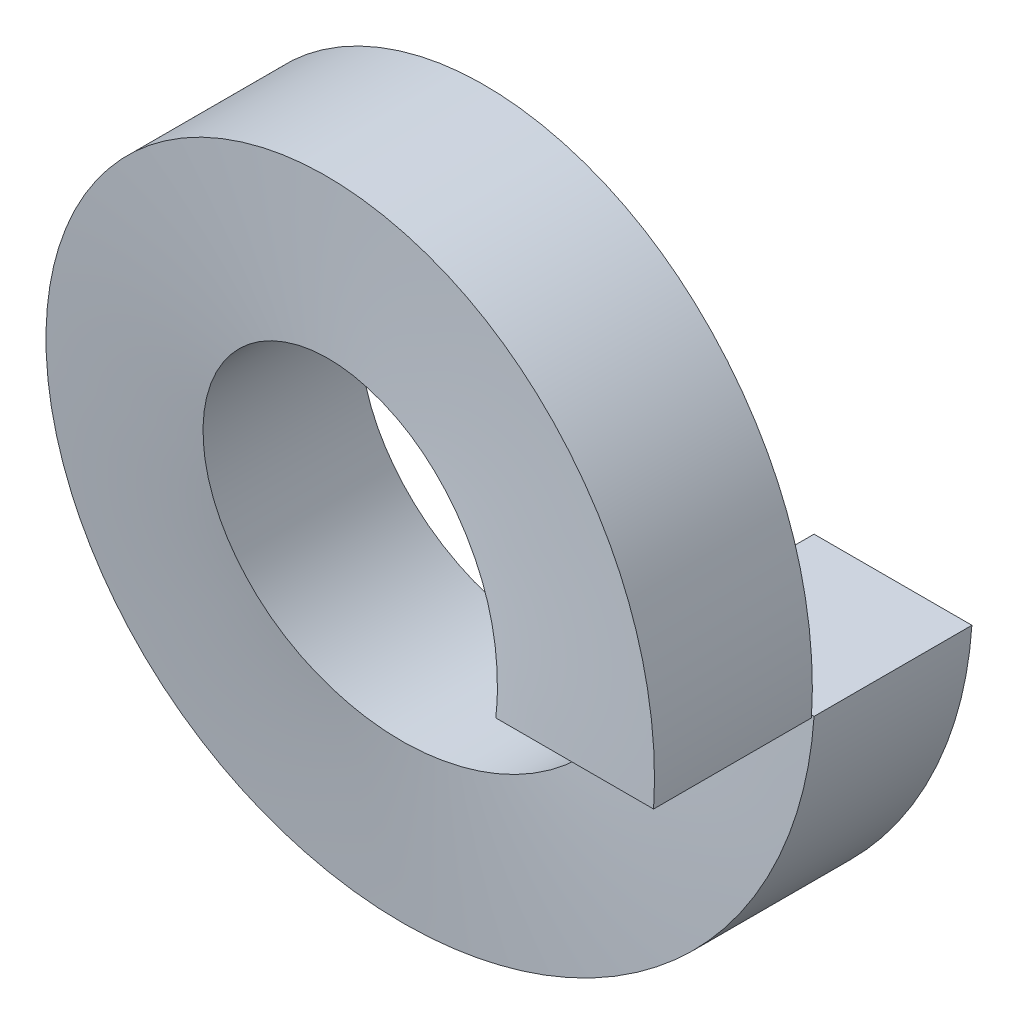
ISO-10303-21;
HEADER;
FILE_DESCRIPTION(('STEP AP214'),'2;1');
FILE_NAME('part.step','',(''),(''),'','','');
FILE_SCHEMA(('AUTOMOTIVE_DESIGN { 1 0 10303 214 1 1 1 1 }'));
ENDSEC;
DATA;
#1=APPLICATION_CONTEXT('core data for automotive mechanical design processes');
#2=APPLICATION_PROTOCOL_DEFINITION('international standard','automotive_design',2000,#1);
#3=PRODUCT_CONTEXT('',#1,'mechanical');
#4=PRODUCT('Part','Part','',(#3));
#5=PRODUCT_RELATED_PRODUCT_CATEGORY('part','',(#4));
#6=PRODUCT_DEFINITION_FORMATION('','',#4);
#7=PRODUCT_DEFINITION_CONTEXT('part definition',#1,'design');
#8=PRODUCT_DEFINITION('design','',#6,#7);
#9=PRODUCT_DEFINITION_SHAPE('','',#8);
#10=(LENGTH_UNIT() NAMED_UNIT(*) SI_UNIT(.MILLI.,.METRE.));
#11=(NAMED_UNIT(*) PLANE_ANGLE_UNIT() SI_UNIT($,.RADIAN.));
#12=(NAMED_UNIT(*) SI_UNIT($,.STERADIAN.) SOLID_ANGLE_UNIT());
#13=UNCERTAINTY_MEASURE_WITH_UNIT(LENGTH_MEASURE(1.E-05),#10,'distance_accuracy_value','');
#14=(GEOMETRIC_REPRESENTATION_CONTEXT(3) GLOBAL_UNCERTAINTY_ASSIGNED_CONTEXT((#13)) GLOBAL_UNIT_ASSIGNED_CONTEXT((#10,
#11,#12)) REPRESENTATION_CONTEXT('',''));
#15=CARTESIAN_POINT('',(0.,0.,0.));
#16=DIRECTION('',(0.,0.,1.));
#17=DIRECTION('',(1.,0.,0.));
#18=AXIS2_PLACEMENT_3D('',#15,#16,#17);
#19=CARTESIAN_POINT('',(3.05,0.,0.910000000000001));
#20=DIRECTION('',(0.,1.,0.));
#21=DIRECTION('',(0.,0.,1.));
#22=AXIS2_PLACEMENT_3D('',#19,#20,#21);
#23=PLANE('',#22);
#24=DIRECTION('',(1.,0.,0.));
#25=VECTOR('',#24,1.);
#26=CARTESIAN_POINT('',(3.05,0.,0.910000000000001));
#27=LINE('',#26,#25);
#28=CARTESIAN_POINT('',(2.14,0.,0.910000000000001));
#29=VERTEX_POINT('',#28);
#30=CARTESIAN_POINT('',(3.96,0.,0.910000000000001));
#31=VERTEX_POINT('',#30);
#32=EDGE_CURVE('E41',#29,#31,#27,.T.);
#33=ORIENTED_EDGE('',*,*,#32,.T.);
#34=DIRECTION('',(0.,0.,-1.));
#35=VECTOR('',#34,1.);
#36=CARTESIAN_POINT('',(3.96,0.,0.));
#37=LINE('',#36,#35);
#38=CARTESIAN_POINT('',(3.96,0.,-0.910000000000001));
#39=VERTEX_POINT('',#38);
#40=EDGE_CURVE('E36',#31,#39,#37,.T.);
#41=ORIENTED_EDGE('',*,*,#40,.T.);
#42=DIRECTION('',(-1.,0.,0.));
#43=VECTOR('',#42,1.);
#44=CARTESIAN_POINT('',(3.05,0.,-0.910000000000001));
#45=LINE('',#44,#43);
#46=CARTESIAN_POINT('',(2.14,0.,-0.910000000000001));
#47=VERTEX_POINT('',#46);
#48=EDGE_CURVE('E76',#39,#47,#45,.T.);
#49=ORIENTED_EDGE('',*,*,#48,.T.);
#50=DIRECTION('',(0.,0.,1.));
#51=VECTOR('',#50,1.);
#52=CARTESIAN_POINT('',(2.14,0.,0.));
#53=LINE('',#52,#51);
#54=EDGE_CURVE('E57',#47,#29,#53,.T.);
#55=ORIENTED_EDGE('',*,*,#54,.T.);
#56=EDGE_LOOP('',(#33,#41,#49,#55));
#57=FACE_BOUND('',#56,.T.);
#58=ADVANCED_FACE('F32',(#57),#23,.T.);
#59=CARTESIAN_POINT('',(3.05,0.,2.76));
#60=DIRECTION('',(0.,-1.,0.));
#61=DIRECTION('',(0.,0.,-1.));
#62=AXIS2_PLACEMENT_3D('',#59,#60,#61);
#63=PLANE('',#62);
#64=DIRECTION('',(-1.,0.,0.));
#65=VECTOR('',#64,1.);
#66=CARTESIAN_POINT('',(3.05,0.,2.76));
#67=LINE('',#66,#65);
#68=CARTESIAN_POINT('',(3.96,0.,2.76));
#69=VERTEX_POINT('',#68);
#70=CARTESIAN_POINT('',(2.14,0.,2.76));
#71=VERTEX_POINT('',#70);
#72=EDGE_CURVE('E11',#69,#71,#67,.T.);
#73=ORIENTED_EDGE('',*,*,#72,.T.);
#74=DIRECTION('',(0.,0.,-1.));
#75=VECTOR('',#74,1.);
#76=CARTESIAN_POINT('',(2.14,0.,1.85));
#77=LINE('',#76,#75);
#78=CARTESIAN_POINT('',(2.14,0.,0.939999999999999));
#79=VERTEX_POINT('',#78);
#80=EDGE_CURVE('E181',#71,#79,#77,.T.);
#81=ORIENTED_EDGE('',*,*,#80,.T.);
#82=DIRECTION('',(1.,0.,0.));
#83=VECTOR('',#82,1.);
#84=CARTESIAN_POINT('',(3.05,0.,0.939999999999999));
#85=LINE('',#84,#83);
#86=CARTESIAN_POINT('',(3.96,0.,0.939999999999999));
#87=VERTEX_POINT('',#86);
#88=EDGE_CURVE('E93',#79,#87,#85,.T.);
#89=ORIENTED_EDGE('',*,*,#88,.T.);
#90=DIRECTION('',(0.,0.,1.));
#91=VECTOR('',#90,1.);
#92=CARTESIAN_POINT('',(3.96,0.,1.85));
#93=LINE('',#92,#91);
#94=EDGE_CURVE('E81',#87,#69,#93,.T.);
#95=ORIENTED_EDGE('',*,*,#94,.T.);
#96=EDGE_LOOP('',(#73,#81,#89,#95));
#97=FACE_BOUND('',#96,.T.);
#98=ADVANCED_FACE('F34',(#97),#63,.T.);
#99=CARTESIAN_POINT('',(2.14,0.,0.910000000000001));
#100=CARTESIAN_POINT('',(2.14,-0.695328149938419,1.0025));
#101=CARTESIAN_POINT('',(1.73129636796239,-1.25786043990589,1.095));
#102=CARTESIAN_POINT('',(1.32259273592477,-1.82039272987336,1.1875));
#103=CARTESIAN_POINT('',(0.661296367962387,-2.03526094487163,1.28));
#104=CARTESIAN_POINT('',(0.,-2.25012915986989,1.3725));
#105=CARTESIAN_POINT('',(-0.661296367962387,-2.03526094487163,1.465));
#106=CARTESIAN_POINT('',(-1.32259273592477,-1.82039272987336,1.5575));
#107=CARTESIAN_POINT('',(-1.73129636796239,-1.25786043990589,1.65));
#108=CARTESIAN_POINT('',(-2.14,-0.69532814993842,1.7425));
#109=CARTESIAN_POINT('',(-2.14,0.,1.835));
#110=CARTESIAN_POINT('',(-2.14,0.695328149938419,1.9275));
#111=CARTESIAN_POINT('',(-1.73129636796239,1.25786043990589,2.02));
#112=CARTESIAN_POINT('',(-1.32259273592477,1.82039272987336,2.1125));
#113=CARTESIAN_POINT('',(-0.661296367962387,2.03526094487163,2.205));
#114=CARTESIAN_POINT('',(0.,2.25012915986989,2.2975));
#115=CARTESIAN_POINT('',(0.661296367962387,2.03526094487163,2.39));
#116=CARTESIAN_POINT('',(1.32259273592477,1.82039272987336,2.4825));
#117=CARTESIAN_POINT('',(1.73129636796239,1.25786043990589,2.575));
#118=CARTESIAN_POINT('',(2.14,0.69532814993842,2.6675));
#119=CARTESIAN_POINT('',(2.14,0.,2.76));
#120=CARTESIAN_POINT('',(3.96,0.,0.910000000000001));
#121=CARTESIAN_POINT('',(3.96,-1.28668199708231,1.0025));
#122=CARTESIAN_POINT('',(3.20370729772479,-2.32762959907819,1.095));
#123=CARTESIAN_POINT('',(2.44741459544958,-3.36857720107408,1.1875));
#124=CARTESIAN_POINT('',(1.22370729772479,-3.76618380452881,1.28));
#125=CARTESIAN_POINT('',(0.,-4.16379040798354,1.3725));
#126=CARTESIAN_POINT('',(-1.22370729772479,-3.76618380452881,1.465));
#127=CARTESIAN_POINT('',(-2.44741459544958,-3.36857720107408,1.5575));
#128=CARTESIAN_POINT('',(-3.20370729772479,-2.32762959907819,1.65));
#129=CARTESIAN_POINT('',(-3.96,-1.28668199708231,1.7425));
#130=CARTESIAN_POINT('',(-3.96,0.,1.835));
#131=CARTESIAN_POINT('',(-3.96,1.28668199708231,1.9275));
#132=CARTESIAN_POINT('',(-3.20370729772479,2.32762959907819,2.02));
#133=CARTESIAN_POINT('',(-2.44741459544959,3.36857720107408,2.1125));
#134=CARTESIAN_POINT('',(-1.22370729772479,3.76618380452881,2.205));
#135=CARTESIAN_POINT('',(0.,4.16379040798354,2.2975));
#136=CARTESIAN_POINT('',(1.22370729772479,3.76618380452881,2.39));
#137=CARTESIAN_POINT('',(2.44741459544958,3.36857720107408,2.4825));
#138=CARTESIAN_POINT('',(3.20370729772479,2.3276295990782,2.575));
#139=CARTESIAN_POINT('',(3.96,1.28668199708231,2.6675));
#140=CARTESIAN_POINT('',(3.96,0.,2.76));
#141=(BOUNDED_SURFACE() B_SPLINE_SURFACE(1,2,((#99,#100,#101,#102,#103,#104,#105,#106,#107,#108,
#109,#110,#111,#112,#113,#114,#115,#116,#117,#118,#119),(#120,#121,#122,#123,#124,#125,#126,
#127,#128,#129,#130,#131,#132,#133,#134,#135,#136,#137,#138,#139,#140)),.UNSPECIFIED.,.F.,.F.,
.F.) B_SPLINE_SURFACE_WITH_KNOTS((2,2),(3,2,2,2,2,2,2,2,2,2,3),(0.,1.),(0.,0.1,0.2,0.3,0.4,0.5,
0.6,0.7,0.8,0.9,1.),
.UNSPECIFIED.) GEOMETRIC_REPRESENTATION_ITEM() RATIONAL_B_SPLINE_SURFACE(((1.,0.951056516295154,
1.,0.951056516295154,1.,0.951056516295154,1.,0.951056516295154,1.,0.951056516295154,1.,
0.951056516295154,1.,0.951056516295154,1.,0.951056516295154,1.,0.951056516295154,1.,
0.951056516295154,1.),(1.,0.951056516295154,1.,0.951056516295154,1.,0.951056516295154,1.,
0.951056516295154,1.,0.951056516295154,1.,0.951056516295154,1.,0.951056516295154,1.,
0.951056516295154,1.,0.951056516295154,1.,0.951056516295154,1.))) REPRESENTATION_ITEM('') SURFACE());
#142=CARTESIAN_POINT('',(2.14,0.,0.910000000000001));
#143=CARTESIAN_POINT('',(2.14,-0.695328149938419,1.0025));
#144=CARTESIAN_POINT('',(1.73129636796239,-1.25786043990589,1.095));
#145=CARTESIAN_POINT('',(1.32259273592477,-1.82039272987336,1.1875));
#146=CARTESIAN_POINT('',(0.661296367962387,-2.03526094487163,1.28));
#147=CARTESIAN_POINT('',(0.,-2.25012915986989,1.3725));
#148=CARTESIAN_POINT('',(-0.661296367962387,-2.03526094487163,1.465));
#149=CARTESIAN_POINT('',(-1.32259273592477,-1.82039272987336,1.5575));
#150=CARTESIAN_POINT('',(-1.73129636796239,-1.25786043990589,1.65));
#151=CARTESIAN_POINT('',(-2.14,-0.69532814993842,1.7425));
#152=CARTESIAN_POINT('',(-2.14,0.,1.835));
#153=CARTESIAN_POINT('',(-2.14,0.695328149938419,1.9275));
#154=CARTESIAN_POINT('',(-1.73129636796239,1.25786043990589,2.02));
#155=CARTESIAN_POINT('',(-1.32259273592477,1.82039272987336,2.1125));
#156=CARTESIAN_POINT('',(-0.661296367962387,2.03526094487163,2.205));
#157=CARTESIAN_POINT('',(0.,2.25012915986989,2.2975));
#158=CARTESIAN_POINT('',(0.661296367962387,2.03526094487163,2.39));
#159=CARTESIAN_POINT('',(1.32259273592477,1.82039272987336,2.4825));
#160=CARTESIAN_POINT('',(1.73129636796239,1.25786043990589,2.575));
#161=CARTESIAN_POINT('',(2.14,0.69532814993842,2.6675));
#162=CARTESIAN_POINT('',(2.14,0.,2.76));
#163=(BOUNDED_CURVE() B_SPLINE_CURVE(2,(#142,#143,#144,#145,#146,#147,#148,#149,#150,#151,#152,
#153,#154,#155,#156,#157,#158,#159,#160,#161,#162),.UNSPECIFIED.,.F.,
.F.) B_SPLINE_CURVE_WITH_KNOTS((3,2,2,2,2,2,2,2,2,2,3),(0.,0.1,0.2,0.3,0.4,0.5,0.6,0.7,0.8,0.9,
1.),.UNSPECIFIED.) CURVE() GEOMETRIC_REPRESENTATION_ITEM() RATIONAL_B_SPLINE_CURVE((1.,
0.951056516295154,1.,0.951056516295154,1.,0.951056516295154,1.,0.951056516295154,1.,
0.951056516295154,1.,0.951056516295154,1.,0.951056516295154,1.,0.951056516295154,1.,
0.951056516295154,1.,0.951056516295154,1.)) REPRESENTATION_ITEM(''));
#164=EDGE_CURVE('E49',#29,#71,#163,.T.);
#165=CARTESIAN_POINT('',(3.96,0.,0.910000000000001));
#166=CARTESIAN_POINT('',(3.96,-1.28668199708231,1.0025));
#167=CARTESIAN_POINT('',(3.20370729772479,-2.32762959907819,1.095));
#168=CARTESIAN_POINT('',(2.44741459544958,-3.36857720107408,1.1875));
#169=CARTESIAN_POINT('',(1.22370729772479,-3.76618380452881,1.28));
#170=CARTESIAN_POINT('',(0.,-4.16379040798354,1.3725));
#171=CARTESIAN_POINT('',(-1.22370729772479,-3.76618380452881,1.465));
#172=CARTESIAN_POINT('',(-2.44741459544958,-3.36857720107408,1.5575));
#173=CARTESIAN_POINT('',(-3.20370729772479,-2.32762959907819,1.65));
#174=CARTESIAN_POINT('',(-3.96,-1.28668199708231,1.7425));
#175=CARTESIAN_POINT('',(-3.96,0.,1.835));
#176=CARTESIAN_POINT('',(-3.96,1.28668199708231,1.9275));
#177=CARTESIAN_POINT('',(-3.20370729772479,2.32762959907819,2.02));
#178=CARTESIAN_POINT('',(-2.44741459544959,3.36857720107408,2.1125));
#179=CARTESIAN_POINT('',(-1.22370729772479,3.76618380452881,2.205));
#180=CARTESIAN_POINT('',(0.,4.16379040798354,2.2975));
#181=CARTESIAN_POINT('',(1.22370729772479,3.76618380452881,2.39));
#182=CARTESIAN_POINT('',(2.44741459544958,3.36857720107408,2.4825));
#183=CARTESIAN_POINT('',(3.20370729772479,2.3276295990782,2.575));
#184=CARTESIAN_POINT('',(3.96,1.28668199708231,2.6675));
#185=CARTESIAN_POINT('',(3.96,0.,2.76));
#186=(BOUNDED_CURVE() B_SPLINE_CURVE(2,(#165,#166,#167,#168,#169,#170,#171,#172,#173,#174,#175,
#176,#177,#178,#179,#180,#181,#182,#183,#184,#185),.UNSPECIFIED.,.F.,
.F.) B_SPLINE_CURVE_WITH_KNOTS((3,2,2,2,2,2,2,2,2,2,3),(0.,0.1,0.2,0.3,0.4,0.5,0.6,0.7,0.8,0.9,
1.),.UNSPECIFIED.) CURVE() GEOMETRIC_REPRESENTATION_ITEM() RATIONAL_B_SPLINE_CURVE((1.,
0.951056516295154,1.,0.951056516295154,1.,0.951056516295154,1.,0.951056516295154,1.,
0.951056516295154,1.,0.951056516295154,1.,0.951056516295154,1.,0.951056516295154,1.,
0.951056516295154,1.,0.951056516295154,1.)) REPRESENTATION_ITEM(''));
#187=EDGE_CURVE('E88',#31,#69,#186,.T.);
#188=ORIENTED_EDGE('',*,*,#32,.F.);
#189=ORIENTED_EDGE('',*,*,#164,.T.);
#190=ORIENTED_EDGE('',*,*,#72,.F.);
#191=ORIENTED_EDGE('',*,*,#187,.F.);
#192=EDGE_LOOP('',(#188,#189,#190,#191));
#193=FACE_BOUND('',#192,.T.);
#194=ADVANCED_FACE('F100',(#193),#141,.F.);
#195=CARTESIAN_POINT('',(2.14,0.,-0.910000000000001));
#196=CARTESIAN_POINT('',(2.14,-0.695328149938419,-0.817500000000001));
#197=CARTESIAN_POINT('',(1.73129636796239,-1.25786043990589,-0.725000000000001));
#198=CARTESIAN_POINT('',(1.32259273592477,-1.82039272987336,-0.632500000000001));
#199=CARTESIAN_POINT('',(0.661296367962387,-2.03526094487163,-0.540000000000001));
#200=CARTESIAN_POINT('',(0.,-2.25012915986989,-0.447500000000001));
#201=CARTESIAN_POINT('',(-0.661296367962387,-2.03526094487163,-0.355000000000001));
#202=CARTESIAN_POINT('',(-1.32259273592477,-1.82039272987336,-0.262500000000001));
#203=CARTESIAN_POINT('',(-1.73129636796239,-1.25786043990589,-0.170000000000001));
#204=CARTESIAN_POINT('',(-2.14,-0.69532814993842,-0.0775000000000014));
#205=CARTESIAN_POINT('',(-2.14,0.,0.0149999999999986));
#206=CARTESIAN_POINT('',(-2.14,0.695328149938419,0.107499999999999));
#207=CARTESIAN_POINT('',(-1.73129636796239,1.25786043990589,0.199999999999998));
#208=CARTESIAN_POINT('',(-1.32259273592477,1.82039272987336,0.292499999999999));
#209=CARTESIAN_POINT('',(-0.661296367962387,2.03526094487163,0.384999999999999));
#210=CARTESIAN_POINT('',(0.,2.25012915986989,0.477499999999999));
#211=CARTESIAN_POINT('',(0.661296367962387,2.03526094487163,0.569999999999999));
#212=CARTESIAN_POINT('',(1.32259273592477,1.82039272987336,0.662499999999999));
#213=CARTESIAN_POINT('',(1.73129636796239,1.25786043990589,0.754999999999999));
#214=CARTESIAN_POINT('',(2.14,0.69532814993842,0.847499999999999));
#215=CARTESIAN_POINT('',(2.14,0.,0.939999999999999));
#216=CARTESIAN_POINT('',(2.14,0.,0.910000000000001));
#217=CARTESIAN_POINT('',(2.14,-0.695328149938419,1.0025));
#218=CARTESIAN_POINT('',(1.73129636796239,-1.25786043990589,1.095));
#219=CARTESIAN_POINT('',(1.32259273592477,-1.82039272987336,1.1875));
#220=CARTESIAN_POINT('',(0.661296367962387,-2.03526094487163,1.28));
#221=CARTESIAN_POINT('',(0.,-2.25012915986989,1.3725));
#222=CARTESIAN_POINT('',(-0.661296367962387,-2.03526094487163,1.465));
#223=CARTESIAN_POINT('',(-1.32259273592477,-1.82039272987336,1.5575));
#224=CARTESIAN_POINT('',(-1.73129636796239,-1.25786043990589,1.65));
#225=CARTESIAN_POINT('',(-2.14,-0.69532814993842,1.7425));
#226=CARTESIAN_POINT('',(-2.14,0.,1.835));
#227=CARTESIAN_POINT('',(-2.14,0.695328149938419,1.9275));
#228=CARTESIAN_POINT('',(-1.73129636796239,1.25786043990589,2.02));
#229=CARTESIAN_POINT('',(-1.32259273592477,1.82039272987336,2.1125));
#230=CARTESIAN_POINT('',(-0.661296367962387,2.03526094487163,2.205));
#231=CARTESIAN_POINT('',(0.,2.25012915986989,2.2975));
#232=CARTESIAN_POINT('',(0.661296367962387,2.03526094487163,2.39));
#233=CARTESIAN_POINT('',(1.32259273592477,1.82039272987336,2.4825));
#234=CARTESIAN_POINT('',(1.73129636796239,1.25786043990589,2.575));
#235=CARTESIAN_POINT('',(2.14,0.69532814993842,2.6675));
#236=CARTESIAN_POINT('',(2.14,0.,2.76));
#237=(BOUNDED_SURFACE() B_SPLINE_SURFACE(1,2,((#195,#196,#197,#198,#199,#200,#201,#202,#203,
#204,#205,#206,#207,#208,#209,#210,#211,#212,#213,#214,#215),(#216,#217,#218,#219,#220,#221,
#222,#223,#224,#225,#226,#227,#228,#229,#230,#231,#232,#233,#234,#235,#236)),.UNSPECIFIED.,.F.,
.F.,.F.) B_SPLINE_SURFACE_WITH_KNOTS((2,2),(3,2,2,2,2,2,2,2,2,2,3),(0.,1.),(0.,0.1,0.2,0.3,0.4,
0.5,0.6,0.7,0.8,0.9,1.),
.UNSPECIFIED.) GEOMETRIC_REPRESENTATION_ITEM() RATIONAL_B_SPLINE_SURFACE(((1.,0.951056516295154,
1.,0.951056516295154,1.,0.951056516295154,1.,0.951056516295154,1.,0.951056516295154,1.,
0.951056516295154,1.,0.951056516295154,1.,0.951056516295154,1.,0.951056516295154,1.,
0.951056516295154,1.),(1.,0.951056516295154,1.,0.951056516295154,1.,0.951056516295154,1.,
0.951056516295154,1.,0.951056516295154,1.,0.951056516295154,1.,0.951056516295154,1.,
0.951056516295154,1.,0.951056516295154,1.,0.951056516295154,1.))) REPRESENTATION_ITEM('') SURFACE());
#238=CARTESIAN_POINT('',(2.14,0.,-0.910000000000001));
#239=CARTESIAN_POINT('',(2.14,-0.695328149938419,-0.817500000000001));
#240=CARTESIAN_POINT('',(1.73129636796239,-1.25786043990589,-0.725000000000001));
#241=CARTESIAN_POINT('',(1.32259273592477,-1.82039272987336,-0.632500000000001));
#242=CARTESIAN_POINT('',(0.661296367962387,-2.03526094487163,-0.540000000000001));
#243=CARTESIAN_POINT('',(0.,-2.25012915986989,-0.447500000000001));
#244=CARTESIAN_POINT('',(-0.661296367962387,-2.03526094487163,-0.355000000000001));
#245=CARTESIAN_POINT('',(-1.32259273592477,-1.82039272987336,-0.262500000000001));
#246=CARTESIAN_POINT('',(-1.73129636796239,-1.25786043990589,-0.170000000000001));
#247=CARTESIAN_POINT('',(-2.14,-0.69532814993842,-0.0775000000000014));
#248=CARTESIAN_POINT('',(-2.14,0.,0.0149999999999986));
#249=CARTESIAN_POINT('',(-2.14,0.695328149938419,0.107499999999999));
#250=CARTESIAN_POINT('',(-1.73129636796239,1.25786043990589,0.199999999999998));
#251=CARTESIAN_POINT('',(-1.32259273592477,1.82039272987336,0.292499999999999));
#252=CARTESIAN_POINT('',(-0.661296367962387,2.03526094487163,0.384999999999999));
#253=CARTESIAN_POINT('',(0.,2.25012915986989,0.477499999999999));
#254=CARTESIAN_POINT('',(0.661296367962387,2.03526094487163,0.569999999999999));
#255=CARTESIAN_POINT('',(1.32259273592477,1.82039272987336,0.662499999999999));
#256=CARTESIAN_POINT('',(1.73129636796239,1.25786043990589,0.754999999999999));
#257=CARTESIAN_POINT('',(2.14,0.69532814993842,0.847499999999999));
#258=CARTESIAN_POINT('',(2.14,0.,0.939999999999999));
#259=(BOUNDED_CURVE() B_SPLINE_CURVE(2,(#238,#239,#240,#241,#242,#243,#244,#245,#246,#247,#248,
#249,#250,#251,#252,#253,#254,#255,#256,#257,#258),.UNSPECIFIED.,.F.,
.F.) B_SPLINE_CURVE_WITH_KNOTS((3,2,2,2,2,2,2,2,2,2,3),(0.,0.1,0.2,0.3,0.4,0.5,0.6,0.7,0.8,0.9,
1.),.UNSPECIFIED.) CURVE() GEOMETRIC_REPRESENTATION_ITEM() RATIONAL_B_SPLINE_CURVE((1.,
0.951056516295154,1.,0.951056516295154,1.,0.951056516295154,1.,0.951056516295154,1.,
0.951056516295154,1.,0.951056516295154,1.,0.951056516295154,1.,0.951056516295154,1.,
0.951056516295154,1.,0.951056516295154,1.)) REPRESENTATION_ITEM(''));
#260=EDGE_CURVE('E91',#47,#79,#259,.T.);
#261=ORIENTED_EDGE('',*,*,#54,.F.);
#262=ORIENTED_EDGE('',*,*,#260,.T.);
#263=ORIENTED_EDGE('',*,*,#80,.F.);
#264=ORIENTED_EDGE('',*,*,#164,.F.);
#265=EDGE_LOOP('',(#261,#262,#263,#264));
#266=FACE_BOUND('',#265,.T.);
#267=ADVANCED_FACE('F102',(#266),#237,.F.);
#268=CARTESIAN_POINT('',(3.96,0.,-0.910000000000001));
#269=CARTESIAN_POINT('',(3.96,-1.28668199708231,-0.817500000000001));
#270=CARTESIAN_POINT('',(3.20370729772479,-2.32762959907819,-0.725000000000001));
#271=CARTESIAN_POINT('',(2.44741459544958,-3.36857720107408,-0.632500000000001));
#272=CARTESIAN_POINT('',(1.22370729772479,-3.76618380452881,-0.540000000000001));
#273=CARTESIAN_POINT('',(0.,-4.16379040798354,-0.447500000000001));
#274=CARTESIAN_POINT('',(-1.22370729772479,-3.76618380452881,-0.355000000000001));
#275=CARTESIAN_POINT('',(-2.44741459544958,-3.36857720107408,-0.262500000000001));
#276=CARTESIAN_POINT('',(-3.20370729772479,-2.32762959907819,-0.170000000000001));
#277=CARTESIAN_POINT('',(-3.96,-1.28668199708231,-0.0775000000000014));
#278=CARTESIAN_POINT('',(-3.96,0.,0.0149999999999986));
#279=CARTESIAN_POINT('',(-3.96,1.28668199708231,0.107499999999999));
#280=CARTESIAN_POINT('',(-3.20370729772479,2.32762959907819,0.199999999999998));
#281=CARTESIAN_POINT('',(-2.44741459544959,3.36857720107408,0.292499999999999));
#282=CARTESIAN_POINT('',(-1.22370729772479,3.76618380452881,0.384999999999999));
#283=CARTESIAN_POINT('',(0.,4.16379040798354,0.477499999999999));
#284=CARTESIAN_POINT('',(1.22370729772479,3.76618380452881,0.569999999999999));
#285=CARTESIAN_POINT('',(2.44741459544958,3.36857720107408,0.662499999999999));
#286=CARTESIAN_POINT('',(3.20370729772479,2.3276295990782,0.754999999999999));
#287=CARTESIAN_POINT('',(3.96,1.28668199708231,0.847499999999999));
#288=CARTESIAN_POINT('',(3.96,0.,0.939999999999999));
#289=CARTESIAN_POINT('',(2.14,0.,-0.910000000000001));
#290=CARTESIAN_POINT('',(2.14,-0.695328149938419,-0.817500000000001));
#291=CARTESIAN_POINT('',(1.73129636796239,-1.25786043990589,-0.725000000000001));
#292=CARTESIAN_POINT('',(1.32259273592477,-1.82039272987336,-0.632500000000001));
#293=CARTESIAN_POINT('',(0.661296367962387,-2.03526094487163,-0.540000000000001));
#294=CARTESIAN_POINT('',(0.,-2.25012915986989,-0.447500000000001));
#295=CARTESIAN_POINT('',(-0.661296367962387,-2.03526094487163,-0.355000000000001));
#296=CARTESIAN_POINT('',(-1.32259273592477,-1.82039272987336,-0.262500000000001));
#297=CARTESIAN_POINT('',(-1.73129636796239,-1.25786043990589,-0.170000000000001));
#298=CARTESIAN_POINT('',(-2.14,-0.69532814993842,-0.0775000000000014));
#299=CARTESIAN_POINT('',(-2.14,0.,0.0149999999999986));
#300=CARTESIAN_POINT('',(-2.14,0.695328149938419,0.107499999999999));
#301=CARTESIAN_POINT('',(-1.73129636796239,1.25786043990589,0.199999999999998));
#302=CARTESIAN_POINT('',(-1.32259273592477,1.82039272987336,0.292499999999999));
#303=CARTESIAN_POINT('',(-0.661296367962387,2.03526094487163,0.384999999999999));
#304=CARTESIAN_POINT('',(0.,2.25012915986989,0.477499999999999));
#305=CARTESIAN_POINT('',(0.661296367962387,2.03526094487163,0.569999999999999));
#306=CARTESIAN_POINT('',(1.32259273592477,1.82039272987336,0.662499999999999));
#307=CARTESIAN_POINT('',(1.73129636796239,1.25786043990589,0.754999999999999));
#308=CARTESIAN_POINT('',(2.14,0.69532814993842,0.847499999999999));
#309=CARTESIAN_POINT('',(2.14,0.,0.939999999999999));
#310=(BOUNDED_SURFACE() B_SPLINE_SURFACE(1,2,((#268,#269,#270,#271,#272,#273,#274,#275,#276,
#277,#278,#279,#280,#281,#282,#283,#284,#285,#286,#287,#288),(#289,#290,#291,#292,#293,#294,
#295,#296,#297,#298,#299,#300,#301,#302,#303,#304,#305,#306,#307,#308,#309)),.UNSPECIFIED.,.F.,
.F.,.F.) B_SPLINE_SURFACE_WITH_KNOTS((2,2),(3,2,2,2,2,2,2,2,2,2,3),(0.,1.),(0.,0.1,0.2,0.3,0.4,
0.5,0.6,0.7,0.8,0.9,1.),
.UNSPECIFIED.) GEOMETRIC_REPRESENTATION_ITEM() RATIONAL_B_SPLINE_SURFACE(((1.,0.951056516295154,
1.,0.951056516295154,1.,0.951056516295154,1.,0.951056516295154,1.,0.951056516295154,1.,
0.951056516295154,1.,0.951056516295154,1.,0.951056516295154,1.,0.951056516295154,1.,
0.951056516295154,1.),(1.,0.951056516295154,1.,0.951056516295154,1.,0.951056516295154,1.,
0.951056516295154,1.,0.951056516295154,1.,0.951056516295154,1.,0.951056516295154,1.,
0.951056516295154,1.,0.951056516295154,1.,0.951056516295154,1.))) REPRESENTATION_ITEM('') SURFACE());
#311=CARTESIAN_POINT('',(3.96,0.,-0.910000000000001));
#312=CARTESIAN_POINT('',(3.96,-1.28668199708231,-0.817500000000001));
#313=CARTESIAN_POINT('',(3.20370729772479,-2.32762959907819,-0.725000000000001));
#314=CARTESIAN_POINT('',(2.44741459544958,-3.36857720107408,-0.632500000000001));
#315=CARTESIAN_POINT('',(1.22370729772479,-3.76618380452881,-0.540000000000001));
#316=CARTESIAN_POINT('',(0.,-4.16379040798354,-0.447500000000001));
#317=CARTESIAN_POINT('',(-1.22370729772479,-3.76618380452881,-0.355000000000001));
#318=CARTESIAN_POINT('',(-2.44741459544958,-3.36857720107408,-0.262500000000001));
#319=CARTESIAN_POINT('',(-3.20370729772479,-2.32762959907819,-0.170000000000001));
#320=CARTESIAN_POINT('',(-3.96,-1.28668199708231,-0.0775000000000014));
#321=CARTESIAN_POINT('',(-3.96,0.,0.0149999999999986));
#322=CARTESIAN_POINT('',(-3.96,1.28668199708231,0.107499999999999));
#323=CARTESIAN_POINT('',(-3.20370729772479,2.32762959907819,0.199999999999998));
#324=CARTESIAN_POINT('',(-2.44741459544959,3.36857720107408,0.292499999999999));
#325=CARTESIAN_POINT('',(-1.22370729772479,3.76618380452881,0.384999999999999));
#326=CARTESIAN_POINT('',(0.,4.16379040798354,0.477499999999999));
#327=CARTESIAN_POINT('',(1.22370729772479,3.76618380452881,0.569999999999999));
#328=CARTESIAN_POINT('',(2.44741459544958,3.36857720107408,0.662499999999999));
#329=CARTESIAN_POINT('',(3.20370729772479,2.3276295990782,0.754999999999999));
#330=CARTESIAN_POINT('',(3.96,1.28668199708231,0.847499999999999));
#331=CARTESIAN_POINT('',(3.96,0.,0.939999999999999));
#332=(BOUNDED_CURVE() B_SPLINE_CURVE(2,(#311,#312,#313,#314,#315,#316,#317,#318,#319,#320,#321,
#322,#323,#324,#325,#326,#327,#328,#329,#330,#331),.UNSPECIFIED.,.F.,
.F.) B_SPLINE_CURVE_WITH_KNOTS((3,2,2,2,2,2,2,2,2,2,3),(0.,0.1,0.2,0.3,0.4,0.5,0.6,0.7,0.8,0.9,
1.),.UNSPECIFIED.) CURVE() GEOMETRIC_REPRESENTATION_ITEM() RATIONAL_B_SPLINE_CURVE((1.,
0.951056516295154,1.,0.951056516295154,1.,0.951056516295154,1.,0.951056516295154,1.,
0.951056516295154,1.,0.951056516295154,1.,0.951056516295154,1.,0.951056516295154,1.,
0.951056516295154,1.,0.951056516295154,1.)) REPRESENTATION_ITEM(''));
#333=EDGE_CURVE('E83',#39,#87,#332,.T.);
#334=ORIENTED_EDGE('',*,*,#48,.F.);
#335=ORIENTED_EDGE('',*,*,#333,.T.);
#336=ORIENTED_EDGE('',*,*,#88,.F.);
#337=ORIENTED_EDGE('',*,*,#260,.F.);
#338=EDGE_LOOP('',(#334,#335,#336,#337));
#339=FACE_BOUND('',#338,.T.);
#340=ADVANCED_FACE('F90',(#339),#310,.F.);
#341=CARTESIAN_POINT('',(3.96,0.,0.910000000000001));
#342=CARTESIAN_POINT('',(3.96,-1.28668199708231,1.0025));
#343=CARTESIAN_POINT('',(3.20370729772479,-2.32762959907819,1.095));
#344=CARTESIAN_POINT('',(2.44741459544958,-3.36857720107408,1.1875));
#345=CARTESIAN_POINT('',(1.22370729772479,-3.76618380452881,1.28));
#346=CARTESIAN_POINT('',(0.,-4.16379040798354,1.3725));
#347=CARTESIAN_POINT('',(-1.22370729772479,-3.76618380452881,1.465));
#348=CARTESIAN_POINT('',(-2.44741459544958,-3.36857720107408,1.5575));
#349=CARTESIAN_POINT('',(-3.20370729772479,-2.32762959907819,1.65));
#350=CARTESIAN_POINT('',(-3.96,-1.28668199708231,1.7425));
#351=CARTESIAN_POINT('',(-3.96,0.,1.835));
#352=CARTESIAN_POINT('',(-3.96,1.28668199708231,1.9275));
#353=CARTESIAN_POINT('',(-3.20370729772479,2.32762959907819,2.02));
#354=CARTESIAN_POINT('',(-2.44741459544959,3.36857720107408,2.1125));
#355=CARTESIAN_POINT('',(-1.22370729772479,3.76618380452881,2.205));
#356=CARTESIAN_POINT('',(0.,4.16379040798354,2.2975));
#357=CARTESIAN_POINT('',(1.22370729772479,3.76618380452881,2.39));
#358=CARTESIAN_POINT('',(2.44741459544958,3.36857720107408,2.4825));
#359=CARTESIAN_POINT('',(3.20370729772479,2.3276295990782,2.575));
#360=CARTESIAN_POINT('',(3.96,1.28668199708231,2.6675));
#361=CARTESIAN_POINT('',(3.96,0.,2.76));
#362=CARTESIAN_POINT('',(3.96,0.,-0.910000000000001));
#363=CARTESIAN_POINT('',(3.96,-1.28668199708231,-0.817500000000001));
#364=CARTESIAN_POINT('',(3.20370729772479,-2.32762959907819,-0.725000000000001));
#365=CARTESIAN_POINT('',(2.44741459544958,-3.36857720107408,-0.632500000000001));
#366=CARTESIAN_POINT('',(1.22370729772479,-3.76618380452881,-0.540000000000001));
#367=CARTESIAN_POINT('',(0.,-4.16379040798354,-0.447500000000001));
#368=CARTESIAN_POINT('',(-1.22370729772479,-3.76618380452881,-0.355000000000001));
#369=CARTESIAN_POINT('',(-2.44741459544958,-3.36857720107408,-0.262500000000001));
#370=CARTESIAN_POINT('',(-3.20370729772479,-2.32762959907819,-0.170000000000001));
#371=CARTESIAN_POINT('',(-3.96,-1.28668199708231,-0.0775000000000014));
#372=CARTESIAN_POINT('',(-3.96,0.,0.0149999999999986));
#373=CARTESIAN_POINT('',(-3.96,1.28668199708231,0.107499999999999));
#374=CARTESIAN_POINT('',(-3.20370729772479,2.32762959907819,0.199999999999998));
#375=CARTESIAN_POINT('',(-2.44741459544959,3.36857720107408,0.292499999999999));
#376=CARTESIAN_POINT('',(-1.22370729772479,3.76618380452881,0.384999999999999));
#377=CARTESIAN_POINT('',(0.,4.16379040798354,0.477499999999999));
#378=CARTESIAN_POINT('',(1.22370729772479,3.76618380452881,0.569999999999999));
#379=CARTESIAN_POINT('',(2.44741459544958,3.36857720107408,0.662499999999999));
#380=CARTESIAN_POINT('',(3.20370729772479,2.3276295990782,0.754999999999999));
#381=CARTESIAN_POINT('',(3.96,1.28668199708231,0.847499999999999));
#382=CARTESIAN_POINT('',(3.96,0.,0.939999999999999));
#383=(BOUNDED_SURFACE() B_SPLINE_SURFACE(1,2,((#341,#342,#343,#344,#345,#346,#347,#348,#349,
#350,#351,#352,#353,#354,#355,#356,#357,#358,#359,#360,#361),(#362,#363,#364,#365,#366,#367,
#368,#369,#370,#371,#372,#373,#374,#375,#376,#377,#378,#379,#380,#381,#382)),.UNSPECIFIED.,.F.,
.F.,.F.) B_SPLINE_SURFACE_WITH_KNOTS((2,2),(3,2,2,2,2,2,2,2,2,2,3),(0.,1.),(0.,0.1,0.2,0.3,0.4,
0.5,0.6,0.7,0.8,0.9,1.),
.UNSPECIFIED.) GEOMETRIC_REPRESENTATION_ITEM() RATIONAL_B_SPLINE_SURFACE(((1.,0.951056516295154,
1.,0.951056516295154,1.,0.951056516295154,1.,0.951056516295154,1.,0.951056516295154,1.,
0.951056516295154,1.,0.951056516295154,1.,0.951056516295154,1.,0.951056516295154,1.,
0.951056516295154,1.),(1.,0.951056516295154,1.,0.951056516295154,1.,0.951056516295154,1.,
0.951056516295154,1.,0.951056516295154,1.,0.951056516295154,1.,0.951056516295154,1.,
0.951056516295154,1.,0.951056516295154,1.,0.951056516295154,1.))) REPRESENTATION_ITEM('') SURFACE());
#384=ORIENTED_EDGE('',*,*,#40,.F.);
#385=ORIENTED_EDGE('',*,*,#187,.T.);
#386=ORIENTED_EDGE('',*,*,#94,.F.);
#387=ORIENTED_EDGE('',*,*,#333,.F.);
#388=EDGE_LOOP('',(#384,#385,#386,#387));
#389=FACE_BOUND('',#388,.T.);
#390=ADVANCED_FACE('F84',(#389),#383,.F.);
#391=CLOSED_SHELL('',(#58,#98,#194,#267,#340,#390));
#392=MANIFOLD_SOLID_BREP('B2',#391);
#393=ADVANCED_BREP_SHAPE_REPRESENTATION('',(#18,#392),#14);
#394=SHAPE_DEFINITION_REPRESENTATION(#9,#393);
ENDSEC;
END-ISO-10303-21;
